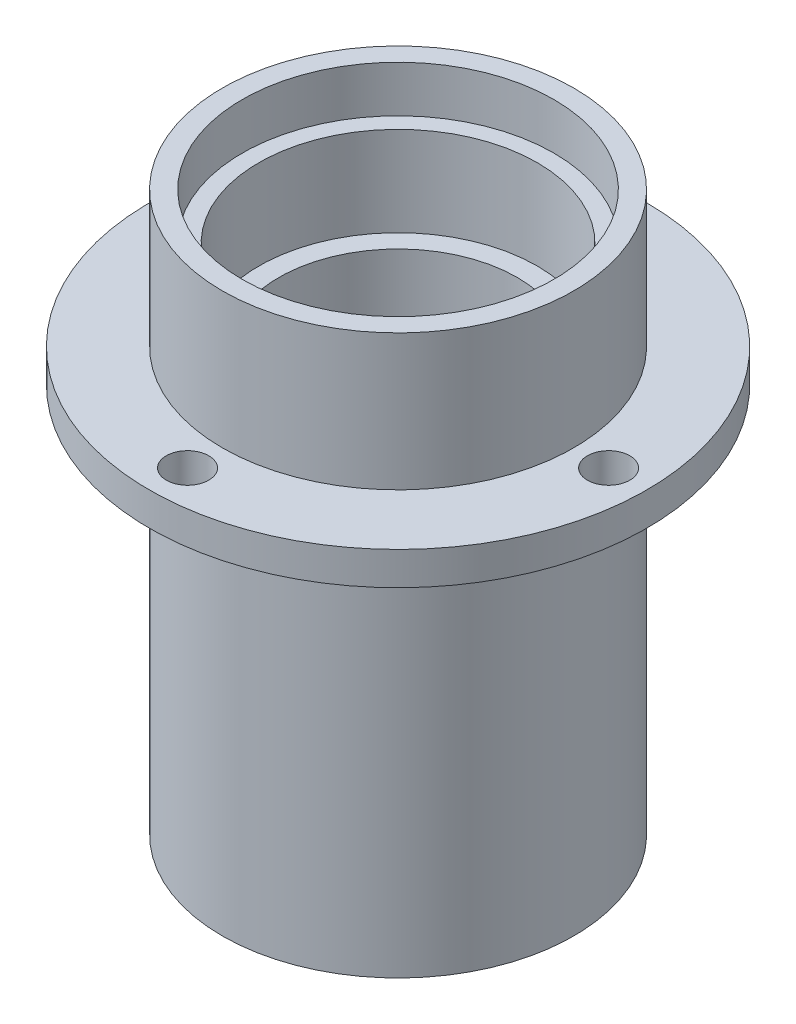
ISO-10303-21;
HEADER;
FILE_DESCRIPTION(('STEP AP214'),'2;1');
FILE_NAME('part.step','',(''),(''),'','','');
FILE_SCHEMA(('AUTOMOTIVE_DESIGN { 1 0 10303 214 1 1 1 1 }'));
ENDSEC;
DATA;
#1=APPLICATION_CONTEXT('core data for automotive mechanical design processes');
#2=APPLICATION_PROTOCOL_DEFINITION('international standard','automotive_design',2000,#1);
#3=PRODUCT_CONTEXT('',#1,'mechanical');
#4=PRODUCT('Part','Part','',(#3));
#5=PRODUCT_RELATED_PRODUCT_CATEGORY('part','',(#4));
#6=PRODUCT_DEFINITION_FORMATION('','',#4);
#7=PRODUCT_DEFINITION_CONTEXT('part definition',#1,'design');
#8=PRODUCT_DEFINITION('design','',#6,#7);
#9=PRODUCT_DEFINITION_SHAPE('','',#8);
#10=(LENGTH_UNIT() NAMED_UNIT(*) SI_UNIT(.MILLI.,.METRE.));
#11=(NAMED_UNIT(*) PLANE_ANGLE_UNIT() SI_UNIT($,.RADIAN.));
#12=(NAMED_UNIT(*) SI_UNIT($,.STERADIAN.) SOLID_ANGLE_UNIT());
#13=UNCERTAINTY_MEASURE_WITH_UNIT(LENGTH_MEASURE(1.E-05),#10,'distance_accuracy_value','');
#14=(GEOMETRIC_REPRESENTATION_CONTEXT(3) GLOBAL_UNCERTAINTY_ASSIGNED_CONTEXT((#13)) GLOBAL_UNIT_ASSIGNED_CONTEXT((#10,
#11,#12)) REPRESENTATION_CONTEXT('',''));
#15=CARTESIAN_POINT('',(0.,0.,0.));
#16=DIRECTION('',(0.,0.,1.));
#17=DIRECTION('',(1.,0.,0.));
#18=AXIS2_PLACEMENT_3D('',#15,#16,#17);
#19=CARTESIAN_POINT('',(0.,84.25,-26.5));
#20=DIRECTION('',(0.,1.,0.));
#21=DIRECTION('',(0.,0.,1.));
#22=AXIS2_PLACEMENT_3D('',#19,#20,#21);
#23=PLANE('',#22);
#24=CARTESIAN_POINT('',(0.,84.25,0.));
#25=DIRECTION('',(0.,-1.,0.));
#26=DIRECTION('',(0.,0.,-1.));
#27=AXIS2_PLACEMENT_3D('',#24,#25,#26);
#28=CIRCLE('',#27,23.5);
#29=CARTESIAN_POINT('',(0.,84.25,-23.5));
#30=VERTEX_POINT('',#29);
#31=EDGE_CURVE('E10',#30,#30,#28,.T.);
#32=ORIENTED_EDGE('',*,*,#31,.T.);
#33=EDGE_LOOP('',(#32));
#34=FACE_BOUND('',#33,.T.);
#35=CARTESIAN_POINT('',(0.,84.25,0.));
#36=DIRECTION('',(0.,-1.,0.));
#37=DIRECTION('',(0.,0.,-1.));
#38=AXIS2_PLACEMENT_3D('',#35,#36,#37);
#39=CIRCLE('',#38,26.5);
#40=CARTESIAN_POINT('',(0.,84.25,-26.5));
#41=VERTEX_POINT('',#40);
#42=EDGE_CURVE('E82',#41,#41,#39,.T.);
#43=ORIENTED_EDGE('',*,*,#42,.F.);
#44=EDGE_LOOP('',(#43));
#45=FACE_BOUND('',#44,.T.);
#46=ADVANCED_FACE('F30',(#34,#45),#23,.T.);
#47=CARTESIAN_POINT('',(0.,-31.9150420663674,0.));
#48=DIRECTION('',(0.,-1.,0.));
#49=DIRECTION('',(0.,0.,-1.));
#50=AXIS2_PLACEMENT_3D('',#47,#48,#49);
#51=CYLINDRICAL_SURFACE('',#50,23.5);
#52=CARTESIAN_POINT('',(0.,77.25,0.));
#53=DIRECTION('',(0.,-1.,0.));
#54=DIRECTION('',(0.,0.,-1.));
#55=AXIS2_PLACEMENT_3D('',#52,#53,#54);
#56=CIRCLE('',#55,23.5);
#57=CARTESIAN_POINT('',(0.,77.25,-23.5));
#58=VERTEX_POINT('',#57);
#59=EDGE_CURVE('E36',#58,#58,#56,.T.);
#60=ORIENTED_EDGE('',*,*,#59,.T.);
#61=EDGE_LOOP('',(#60));
#62=FACE_BOUND('',#61,.T.);
#63=ORIENTED_EDGE('',*,*,#31,.F.);
#64=EDGE_LOOP('',(#63));
#65=FACE_BOUND('',#64,.T.);
#66=ADVANCED_FACE('F197',(#62,#65),#51,.F.);
#67=CARTESIAN_POINT('',(0.,77.25,-23.5));
#68=DIRECTION('',(0.,1.,0.));
#69=DIRECTION('',(0.,0.,1.));
#70=AXIS2_PLACEMENT_3D('',#67,#68,#69);
#71=PLANE('',#70);
#72=CARTESIAN_POINT('',(0.,77.25,0.));
#73=DIRECTION('',(0.,-1.,0.));
#74=DIRECTION('',(0.,0.,-1.));
#75=AXIS2_PLACEMENT_3D('',#72,#73,#74);
#76=CIRCLE('',#75,21.);
#77=CARTESIAN_POINT('',(0.,77.25,-21.));
#78=VERTEX_POINT('',#77);
#79=EDGE_CURVE('E40',#78,#78,#76,.T.);
#80=ORIENTED_EDGE('',*,*,#79,.T.);
#81=EDGE_LOOP('',(#80));
#82=FACE_BOUND('',#81,.T.);
#83=ORIENTED_EDGE('',*,*,#59,.F.);
#84=EDGE_LOOP('',(#83));
#85=FACE_BOUND('',#84,.T.);
#86=ADVANCED_FACE('F191',(#82,#85),#71,.T.);
#87=CARTESIAN_POINT('',(0.,-31.9150420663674,0.));
#88=DIRECTION('',(0.,-1.,0.));
#89=DIRECTION('',(0.,0.,-1.));
#90=AXIS2_PLACEMENT_3D('',#87,#88,#89);
#91=CYLINDRICAL_SURFACE('',#90,21.);
#92=CARTESIAN_POINT('',(0.,63.75,0.));
#93=DIRECTION('',(0.,-1.,0.));
#94=DIRECTION('',(0.,0.,-1.));
#95=AXIS2_PLACEMENT_3D('',#92,#93,#94);
#96=CIRCLE('',#95,21.);
#97=CARTESIAN_POINT('',(0.,63.75,-21.));
#98=VERTEX_POINT('',#97);
#99=EDGE_CURVE('E44',#98,#98,#96,.T.);
#100=ORIENTED_EDGE('',*,*,#99,.T.);
#101=EDGE_LOOP('',(#100));
#102=FACE_BOUND('',#101,.T.);
#103=ORIENTED_EDGE('',*,*,#79,.F.);
#104=EDGE_LOOP('',(#103));
#105=FACE_BOUND('',#104,.T.);
#106=ADVANCED_FACE('F185',(#102,#105),#91,.F.);
#107=CARTESIAN_POINT('',(0.,63.75,-18.));
#108=DIRECTION('',(0.,1.,0.));
#109=DIRECTION('',(0.,0.,1.));
#110=AXIS2_PLACEMENT_3D('',#107,#108,#109);
#111=PLANE('',#110);
#112=CARTESIAN_POINT('',(0.,63.75,0.));
#113=DIRECTION('',(0.,-1.,0.));
#114=DIRECTION('',(0.,0.,-1.));
#115=AXIS2_PLACEMENT_3D('',#112,#113,#114);
#116=CIRCLE('',#115,18.);
#117=CARTESIAN_POINT('',(0.,63.75,-18.));
#118=VERTEX_POINT('',#117);
#119=EDGE_CURVE('E49',#118,#118,#116,.T.);
#120=ORIENTED_EDGE('',*,*,#119,.T.);
#121=EDGE_LOOP('',(#120));
#122=FACE_BOUND('',#121,.T.);
#123=ORIENTED_EDGE('',*,*,#99,.F.);
#124=EDGE_LOOP('',(#123));
#125=FACE_BOUND('',#124,.T.);
#126=ADVANCED_FACE('F179',(#122,#125),#111,.T.);
#127=CARTESIAN_POINT('',(0.,-31.9150420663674,0.));
#128=DIRECTION('',(0.,-1.,0.));
#129=DIRECTION('',(0.,0.,-1.));
#130=AXIS2_PLACEMENT_3D('',#127,#128,#129);
#131=CYLINDRICAL_SURFACE('',#130,18.);
#132=CARTESIAN_POINT('',(0.,20.5,0.));
#133=DIRECTION('',(0.,-1.,0.));
#134=DIRECTION('',(0.,0.,-1.));
#135=AXIS2_PLACEMENT_3D('',#132,#133,#134);
#136=CIRCLE('',#135,18.);
#137=CARTESIAN_POINT('',(0.,20.5,-18.));
#138=VERTEX_POINT('',#137);
#139=EDGE_CURVE('E52',#138,#138,#136,.T.);
#140=ORIENTED_EDGE('',*,*,#139,.T.);
#141=EDGE_LOOP('',(#140));
#142=FACE_BOUND('',#141,.T.);
#143=ORIENTED_EDGE('',*,*,#119,.F.);
#144=EDGE_LOOP('',(#143));
#145=FACE_BOUND('',#144,.T.);
#146=ADVANCED_FACE('F173',(#142,#145),#131,.F.);
#147=CARTESIAN_POINT('',(0.,20.5,-21.));
#148=DIRECTION('',(0.,-1.,0.));
#149=DIRECTION('',(0.,0.,-1.));
#150=AXIS2_PLACEMENT_3D('',#147,#148,#149);
#151=PLANE('',#150);
#152=CARTESIAN_POINT('',(0.,20.5,0.));
#153=DIRECTION('',(0.,-1.,0.));
#154=DIRECTION('',(0.,0.,-1.));
#155=AXIS2_PLACEMENT_3D('',#152,#153,#154);
#156=CIRCLE('',#155,21.);
#157=CARTESIAN_POINT('',(0.,20.5,-21.));
#158=VERTEX_POINT('',#157);
#159=EDGE_CURVE('E55',#158,#158,#156,.T.);
#160=ORIENTED_EDGE('',*,*,#159,.T.);
#161=EDGE_LOOP('',(#160));
#162=FACE_BOUND('',#161,.T.);
#163=ORIENTED_EDGE('',*,*,#139,.F.);
#164=EDGE_LOOP('',(#163));
#165=FACE_BOUND('',#164,.T.);
#166=ADVANCED_FACE('F167',(#162,#165),#151,.T.);
#167=CARTESIAN_POINT('',(0.,-31.9150420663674,0.));
#168=DIRECTION('',(0.,-1.,0.));
#169=DIRECTION('',(0.,0.,-1.));
#170=AXIS2_PLACEMENT_3D('',#167,#168,#169);
#171=CYLINDRICAL_SURFACE('',#170,21.);
#172=CARTESIAN_POINT('',(0.,7.00000000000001,0.));
#173=DIRECTION('',(0.,-1.,0.));
#174=DIRECTION('',(0.,0.,-1.));
#175=AXIS2_PLACEMENT_3D('',#172,#173,#174);
#176=CIRCLE('',#175,21.);
#177=CARTESIAN_POINT('',(0.,7.00000000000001,-21.));
#178=VERTEX_POINT('',#177);
#179=EDGE_CURVE('E58',#178,#178,#176,.T.);
#180=ORIENTED_EDGE('',*,*,#179,.T.);
#181=EDGE_LOOP('',(#180));
#182=FACE_BOUND('',#181,.T.);
#183=ORIENTED_EDGE('',*,*,#159,.F.);
#184=EDGE_LOOP('',(#183));
#185=FACE_BOUND('',#184,.T.);
#186=ADVANCED_FACE('F161',(#182,#185),#171,.F.);
#187=CARTESIAN_POINT('',(0.,7.,-23.5));
#188=DIRECTION('',(0.,-1.,0.));
#189=DIRECTION('',(0.,0.,-1.));
#190=AXIS2_PLACEMENT_3D('',#187,#188,#189);
#191=PLANE('',#190);
#192=CARTESIAN_POINT('',(0.,7.,0.));
#193=DIRECTION('',(0.,-1.,0.));
#194=DIRECTION('',(0.,0.,-1.));
#195=AXIS2_PLACEMENT_3D('',#192,#193,#194);
#196=CIRCLE('',#195,23.5);
#197=CARTESIAN_POINT('',(0.,7.,-23.5));
#198=VERTEX_POINT('',#197);
#199=EDGE_CURVE('E61',#198,#198,#196,.T.);
#200=ORIENTED_EDGE('',*,*,#199,.T.);
#201=EDGE_LOOP('',(#200));
#202=FACE_BOUND('',#201,.T.);
#203=ORIENTED_EDGE('',*,*,#179,.F.);
#204=EDGE_LOOP('',(#203));
#205=FACE_BOUND('',#204,.T.);
#206=ADVANCED_FACE('F155',(#202,#205),#191,.T.);
#207=CARTESIAN_POINT('',(0.,-31.9150420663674,0.));
#208=DIRECTION('',(0.,-1.,0.));
#209=DIRECTION('',(0.,0.,-1.));
#210=AXIS2_PLACEMENT_3D('',#207,#208,#209);
#211=CYLINDRICAL_SURFACE('',#210,23.5);
#212=CARTESIAN_POINT('',(0.,0.,0.));
#213=DIRECTION('',(0.,-1.,0.));
#214=DIRECTION('',(0.,0.,-1.));
#215=AXIS2_PLACEMENT_3D('',#212,#213,#214);
#216=CIRCLE('',#215,23.5);
#217=CARTESIAN_POINT('',(0.,0.,-23.5));
#218=VERTEX_POINT('',#217);
#219=EDGE_CURVE('E64',#218,#218,#216,.T.);
#220=ORIENTED_EDGE('',*,*,#219,.T.);
#221=EDGE_LOOP('',(#220));
#222=FACE_BOUND('',#221,.T.);
#223=ORIENTED_EDGE('',*,*,#199,.F.);
#224=EDGE_LOOP('',(#223));
#225=FACE_BOUND('',#224,.T.);
#226=ADVANCED_FACE('F149',(#222,#225),#211,.F.);
#227=CARTESIAN_POINT('',(0.,0.,-23.5));
#228=DIRECTION('',(0.,-1.,0.));
#229=DIRECTION('',(0.,0.,-1.));
#230=AXIS2_PLACEMENT_3D('',#227,#228,#229);
#231=PLANE('',#230);
#232=CARTESIAN_POINT('',(0.,0.,0.));
#233=DIRECTION('',(0.,-1.,0.));
#234=DIRECTION('',(0.,0.,-1.));
#235=AXIS2_PLACEMENT_3D('',#232,#233,#234);
#236=CIRCLE('',#235,26.5);
#237=CARTESIAN_POINT('',(0.,0.,-26.5));
#238=VERTEX_POINT('',#237);
#239=EDGE_CURVE('E67',#238,#238,#236,.T.);
#240=ORIENTED_EDGE('',*,*,#239,.T.);
#241=EDGE_LOOP('',(#240));
#242=FACE_BOUND('',#241,.T.);
#243=ORIENTED_EDGE('',*,*,#219,.F.);
#244=EDGE_LOOP('',(#243));
#245=FACE_BOUND('',#244,.T.);
#246=ADVANCED_FACE('F143',(#242,#245),#231,.T.);
#247=CARTESIAN_POINT('',(0.,-31.9150420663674,0.));
#248=DIRECTION('',(0.,-1.,0.));
#249=DIRECTION('',(0.,0.,-1.));
#250=AXIS2_PLACEMENT_3D('',#247,#248,#249);
#251=CYLINDRICAL_SURFACE('',#250,26.5);
#252=CARTESIAN_POINT('',(0.,58.75,0.));
#253=DIRECTION('',(0.,-1.,0.));
#254=DIRECTION('',(0.,0.,-1.));
#255=AXIS2_PLACEMENT_3D('',#252,#253,#254);
#256=CIRCLE('',#255,26.5);
#257=CARTESIAN_POINT('',(0.,58.75,-26.5));
#258=VERTEX_POINT('',#257);
#259=EDGE_CURVE('E70',#258,#258,#256,.T.);
#260=ORIENTED_EDGE('',*,*,#259,.T.);
#261=EDGE_LOOP('',(#260));
#262=FACE_BOUND('',#261,.T.);
#263=ORIENTED_EDGE('',*,*,#239,.F.);
#264=EDGE_LOOP('',(#263));
#265=FACE_BOUND('',#264,.T.);
#266=ADVANCED_FACE('F136',(#262,#265),#251,.T.);
#267=CARTESIAN_POINT('',(0.,58.75,-26.5));
#268=DIRECTION('',(0.,-1.,0.));
#269=DIRECTION('',(0.,0.,-1.));
#270=AXIS2_PLACEMENT_3D('',#267,#268,#269);
#271=PLANE('',#270);
#272=CARTESIAN_POINT('',(3.22155449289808E-13,58.75,-31.75));
#273=DIRECTION('',(0.,-1.,0.));
#274=DIRECTION('',(0.,0.,-1.));
#275=AXIS2_PLACEMENT_3D('',#272,#273,#274);
#276=CIRCLE('',#275,3.2);
#277=CARTESIAN_POINT('',(3.22155449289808E-13,58.75,-34.95));
#278=VERTEX_POINT('',#277);
#279=EDGE_CURVE('E103',#278,#278,#276,.T.);
#280=ORIENTED_EDGE('',*,*,#279,.F.);
#281=EDGE_LOOP('',(#280));
#282=FACE_BOUND('',#281,.T.);
#283=CARTESIAN_POINT('',(-31.75,58.75,-2.18239746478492E-13));
#284=DIRECTION('',(0.,-1.,0.));
#285=DIRECTION('',(0.,0.,-1.));
#286=AXIS2_PLACEMENT_3D('',#283,#284,#285);
#287=CIRCLE('',#286,3.2);
#288=CARTESIAN_POINT('',(-31.75,58.75,-3.20000000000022));
#289=VERTEX_POINT('',#288);
#290=EDGE_CURVE('E97',#289,#289,#287,.T.);
#291=ORIENTED_EDGE('',*,*,#290,.F.);
#292=EDGE_LOOP('',(#291));
#293=FACE_BOUND('',#292,.T.);
#294=CARTESIAN_POINT('',(-1.00446255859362E-13,58.75,31.75));
#295=DIRECTION('',(0.,-1.,0.));
#296=DIRECTION('',(0.,0.,-1.));
#297=AXIS2_PLACEMENT_3D('',#294,#295,#296);
#298=CIRCLE('',#297,3.2);
#299=CARTESIAN_POINT('',(-1.00446255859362E-13,58.75,28.55));
#300=VERTEX_POINT('',#299);
#301=EDGE_CURVE('E91',#300,#300,#298,.T.);
#302=ORIENTED_EDGE('',*,*,#301,.F.);
#303=EDGE_LOOP('',(#302));
#304=FACE_BOUND('',#303,.T.);
#305=CARTESIAN_POINT('',(31.75,58.75,0.));
#306=DIRECTION('',(0.,-1.,0.));
#307=DIRECTION('',(0.,0.,-1.));
#308=AXIS2_PLACEMENT_3D('',#305,#306,#307);
#309=CIRCLE('',#308,3.2);
#310=CARTESIAN_POINT('',(31.75,58.75,-3.20000000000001));
#311=VERTEX_POINT('',#310);
#312=EDGE_CURVE('E85',#311,#311,#309,.T.);
#313=ORIENTED_EDGE('',*,*,#312,.F.);
#314=EDGE_LOOP('',(#313));
#315=FACE_BOUND('',#314,.T.);
#316=CARTESIAN_POINT('',(0.,58.75,0.));
#317=DIRECTION('',(0.,-1.,0.));
#318=DIRECTION('',(0.,0.,-1.));
#319=AXIS2_PLACEMENT_3D('',#316,#317,#318);
#320=CIRCLE('',#319,37.5);
#321=CARTESIAN_POINT('',(0.,58.75,-37.5));
#322=VERTEX_POINT('',#321);
#323=EDGE_CURVE('E73',#322,#322,#320,.T.);
#324=ORIENTED_EDGE('',*,*,#323,.T.);
#325=EDGE_LOOP('',(#324));
#326=FACE_BOUND('',#325,.T.);
#327=ORIENTED_EDGE('',*,*,#259,.F.);
#328=EDGE_LOOP('',(#327));
#329=FACE_BOUND('',#328,.T.);
#330=ADVANCED_FACE('F130',(#282,#293,#304,#315,#326,#329),#271,.T.);
#331=CARTESIAN_POINT('',(0.,-31.9150420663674,0.));
#332=DIRECTION('',(0.,-1.,0.));
#333=DIRECTION('',(0.,0.,-1.));
#334=AXIS2_PLACEMENT_3D('',#331,#332,#333);
#335=CYLINDRICAL_SURFACE('',#334,37.5);
#336=CARTESIAN_POINT('',(0.,63.75,0.));
#337=DIRECTION('',(0.,-1.,0.));
#338=DIRECTION('',(0.,0.,-1.));
#339=AXIS2_PLACEMENT_3D('',#336,#337,#338);
#340=CIRCLE('',#339,37.5);
#341=CARTESIAN_POINT('',(0.,63.75,-37.5));
#342=VERTEX_POINT('',#341);
#343=EDGE_CURVE('E76',#342,#342,#340,.T.);
#344=ORIENTED_EDGE('',*,*,#343,.T.);
#345=EDGE_LOOP('',(#344));
#346=FACE_BOUND('',#345,.T.);
#347=ORIENTED_EDGE('',*,*,#323,.F.);
#348=EDGE_LOOP('',(#347));
#349=FACE_BOUND('',#348,.T.);
#350=ADVANCED_FACE('F116',(#346,#349),#335,.T.);
#351=CARTESIAN_POINT('',(0.,63.75,-37.5));
#352=DIRECTION('',(0.,1.,0.));
#353=DIRECTION('',(0.,0.,1.));
#354=AXIS2_PLACEMENT_3D('',#351,#352,#353);
#355=PLANE('',#354);
#356=CARTESIAN_POINT('',(3.22155449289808E-13,63.75,-31.75));
#357=DIRECTION('',(0.,1.,0.));
#358=DIRECTION('',(0.,0.,1.));
#359=AXIS2_PLACEMENT_3D('',#356,#357,#358);
#360=CIRCLE('',#359,3.2);
#361=CARTESIAN_POINT('',(3.22155449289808E-13,63.75,-28.55));
#362=VERTEX_POINT('',#361);
#363=EDGE_CURVE('E106',#362,#362,#360,.T.);
#364=ORIENTED_EDGE('',*,*,#363,.F.);
#365=EDGE_LOOP('',(#364));
#366=FACE_BOUND('',#365,.T.);
#367=CARTESIAN_POINT('',(-31.75,63.75,-2.18239746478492E-13));
#368=DIRECTION('',(0.,1.,0.));
#369=DIRECTION('',(0.,0.,1.));
#370=AXIS2_PLACEMENT_3D('',#367,#368,#369);
#371=CIRCLE('',#370,3.2);
#372=CARTESIAN_POINT('',(-31.75,63.75,3.19999999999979));
#373=VERTEX_POINT('',#372);
#374=EDGE_CURVE('E100',#373,#373,#371,.T.);
#375=ORIENTED_EDGE('',*,*,#374,.F.);
#376=EDGE_LOOP('',(#375));
#377=FACE_BOUND('',#376,.T.);
#378=CARTESIAN_POINT('',(-1.00446255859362E-13,63.75,31.75));
#379=DIRECTION('',(0.,1.,0.));
#380=DIRECTION('',(0.,0.,1.));
#381=AXIS2_PLACEMENT_3D('',#378,#379,#380);
#382=CIRCLE('',#381,3.2);
#383=CARTESIAN_POINT('',(-1.00446255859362E-13,63.75,34.95));
#384=VERTEX_POINT('',#383);
#385=EDGE_CURVE('E94',#384,#384,#382,.T.);
#386=ORIENTED_EDGE('',*,*,#385,.F.);
#387=EDGE_LOOP('',(#386));
#388=FACE_BOUND('',#387,.T.);
#389=CARTESIAN_POINT('',(31.75,63.75,0.));
#390=DIRECTION('',(0.,1.,0.));
#391=DIRECTION('',(0.,0.,1.));
#392=AXIS2_PLACEMENT_3D('',#389,#390,#391);
#393=CIRCLE('',#392,3.2);
#394=CARTESIAN_POINT('',(31.75,63.75,3.2));
#395=VERTEX_POINT('',#394);
#396=EDGE_CURVE('E88',#395,#395,#393,.T.);
#397=ORIENTED_EDGE('',*,*,#396,.F.);
#398=EDGE_LOOP('',(#397));
#399=FACE_BOUND('',#398,.T.);
#400=CARTESIAN_POINT('',(0.,63.75,0.));
#401=DIRECTION('',(0.,-1.,0.));
#402=DIRECTION('',(0.,0.,-1.));
#403=AXIS2_PLACEMENT_3D('',#400,#401,#402);
#404=CIRCLE('',#403,26.5);
#405=CARTESIAN_POINT('',(0.,63.75,-26.5));
#406=VERTEX_POINT('',#405);
#407=EDGE_CURVE('E79',#406,#406,#404,.T.);
#408=ORIENTED_EDGE('',*,*,#407,.T.);
#409=EDGE_LOOP('',(#408));
#410=FACE_BOUND('',#409,.T.);
#411=ORIENTED_EDGE('',*,*,#343,.F.);
#412=EDGE_LOOP('',(#411));
#413=FACE_BOUND('',#412,.T.);
#414=ADVANCED_FACE('F112',(#366,#377,#388,#399,#410,#413),#355,.T.);
#415=CARTESIAN_POINT('',(0.,-31.9150420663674,0.));
#416=DIRECTION('',(0.,-1.,0.));
#417=DIRECTION('',(0.,0.,-1.));
#418=AXIS2_PLACEMENT_3D('',#415,#416,#417);
#419=CYLINDRICAL_SURFACE('',#418,26.5);
#420=ORIENTED_EDGE('',*,*,#42,.T.);
#421=EDGE_LOOP('',(#420));
#422=FACE_BOUND('',#421,.T.);
#423=ORIENTED_EDGE('',*,*,#407,.F.);
#424=EDGE_LOOP('',(#423));
#425=FACE_BOUND('',#424,.T.);
#426=ADVANCED_FACE('F115',(#422,#425),#419,.T.);
#427=CARTESIAN_POINT('',(31.75,53.75,0.));
#428=DIRECTION('',(0.,1.,0.));
#429=DIRECTION('',(0.,0.,1.));
#430=AXIS2_PLACEMENT_3D('',#427,#428,#429);
#431=CYLINDRICAL_SURFACE('',#430,3.2);
#432=ORIENTED_EDGE('',*,*,#312,.T.);
#433=EDGE_LOOP('',(#432));
#434=FACE_BOUND('',#433,.T.);
#435=ORIENTED_EDGE('',*,*,#396,.T.);
#436=EDGE_LOOP('',(#435));
#437=FACE_BOUND('',#436,.T.);
#438=ADVANCED_FACE('F210',(#434,#437),#431,.F.);
#439=CARTESIAN_POINT('',(-1.00446255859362E-13,53.75,31.75));
#440=DIRECTION('',(0.,1.,0.));
#441=DIRECTION('',(0.,0.,1.));
#442=AXIS2_PLACEMENT_3D('',#439,#440,#441);
#443=CYLINDRICAL_SURFACE('',#442,3.2);
#444=ORIENTED_EDGE('',*,*,#301,.T.);
#445=EDGE_LOOP('',(#444));
#446=FACE_BOUND('',#445,.T.);
#447=ORIENTED_EDGE('',*,*,#385,.T.);
#448=EDGE_LOOP('',(#447));
#449=FACE_BOUND('',#448,.T.);
#450=ADVANCED_FACE('F215',(#446,#449),#443,.F.);
#451=CARTESIAN_POINT('',(-31.75,53.75,-2.18239746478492E-13));
#452=DIRECTION('',(0.,1.,0.));
#453=DIRECTION('',(0.,0.,1.));
#454=AXIS2_PLACEMENT_3D('',#451,#452,#453);
#455=CYLINDRICAL_SURFACE('',#454,3.2);
#456=ORIENTED_EDGE('',*,*,#290,.T.);
#457=EDGE_LOOP('',(#456));
#458=FACE_BOUND('',#457,.T.);
#459=ORIENTED_EDGE('',*,*,#374,.T.);
#460=EDGE_LOOP('',(#459));
#461=FACE_BOUND('',#460,.T.);
#462=ADVANCED_FACE('F221',(#458,#461),#455,.F.);
#463=CARTESIAN_POINT('',(3.22155449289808E-13,53.75,-31.75));
#464=DIRECTION('',(0.,1.,0.));
#465=DIRECTION('',(0.,0.,1.));
#466=AXIS2_PLACEMENT_3D('',#463,#464,#465);
#467=CYLINDRICAL_SURFACE('',#466,3.2);
#468=ORIENTED_EDGE('',*,*,#279,.T.);
#469=EDGE_LOOP('',(#468));
#470=FACE_BOUND('',#469,.T.);
#471=ORIENTED_EDGE('',*,*,#363,.T.);
#472=EDGE_LOOP('',(#471));
#473=FACE_BOUND('',#472,.T.);
#474=ADVANCED_FACE('F110',(#470,#473),#467,.F.);
#475=CLOSED_SHELL('',(#46,#66,#86,#106,#126,#146,#166,#186,#206,#226,#246,#266,#330,#350,#414,
#426,#438,#450,#462,#474));
#476=MANIFOLD_SOLID_BREP('B2',#475);
#477=ADVANCED_BREP_SHAPE_REPRESENTATION('',(#18,#476),#14);
#478=SHAPE_DEFINITION_REPRESENTATION(#9,#477);
ENDSEC;
END-ISO-10303-21;
